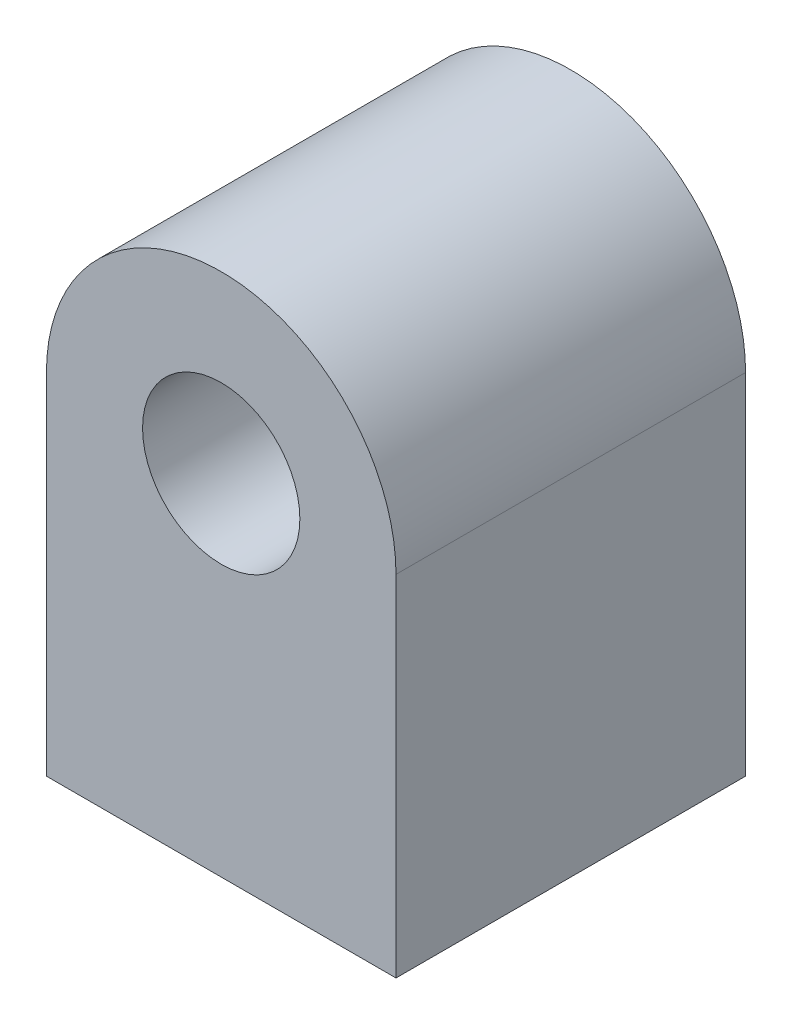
from build123d import *

# Parameters (mm, degrees)
EXTRUSION1_DEPTH           = 20
TROU_TARAUD_M10X1_01_D     = 9
TROU_TARAUD_M10X1_01_DEPTH = 23
TROU_TARAUD_M10X1_01_TIP   = 2.703872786


with BuildPart() as part:
    # Esquisse1 → Extrusion1 (new body)
    with BuildSketch(Plane.XY):
        with BuildLine():
            Line((0, 0), (20, 0))
            Line((20, 0), (20, 20))
            ThreePointArc((20, 20), (10, 30), (0, 20))
            Line((0, 20), (0, 0))
        make_face()
    extrude(amount=EXTRUSION1_DEPTH)

    # Trou taraud_ M10x1.01
    with Locations(Plane(origin=(10, 20, 20), x_dir=(1, 0, 0), z_dir=(0, 0, 1))):
        with Locations((0, 0)):
            Hole(TROU_TARAUD_M10X1_01_D / 2, depth=TROU_TARAUD_M10X1_01_DEPTH)
            with Locations((0, 0, -(TROU_TARAUD_M10X1_01_DEPTH + TROU_TARAUD_M10X1_01_TIP / 2))):  # 118° drill point
                Cone(0, TROU_TARAUD_M10X1_01_D / 2, TROU_TARAUD_M10X1_01_TIP, mode=Mode.SUBTRACT)


solid = part.part
